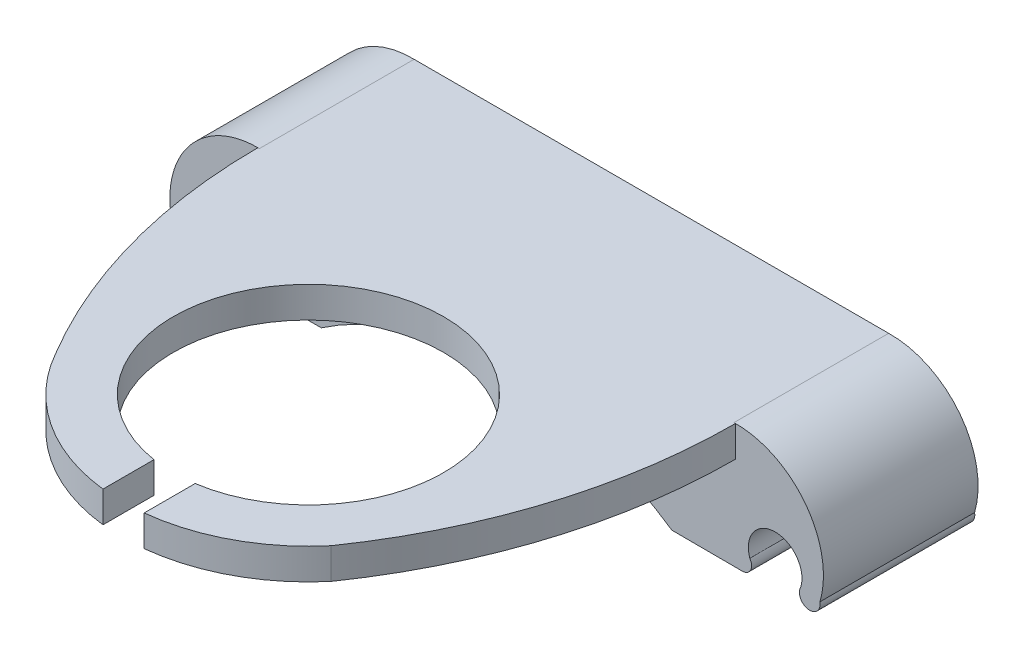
from build123d import *

# Parameters (mm, degrees)
EXTRUDE_1_DEPTH     = 15
SKETCH_2_R          = 13.1
EXTRUDE_2_DEPTH     = 3
CUT_EXTRUDE_1_DEPTH = 70.709658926


with BuildPart() as part:
    # Sketch 1 → Extrude 1 (new body)
    with BuildSketch(Plane.XY):
        with BuildLine():
            Line((-48.75317165, 0), (-55.574899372, -0.025613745))
            ThreePointArc((-55.574899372, -0.025613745), (-56.384360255, 0.467704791), (-56.309824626, 1.412709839))
            ThreePointArc((-56.309824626, 1.412709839), (-58.768154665, 4.862275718), (-61.223704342, 1.410730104))
            ThreePointArc((-61.223704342, 1.410730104), (-61.978317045, -0.033348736), (-63.095743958, 1.152467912))
            ThreePointArc((-63.095743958, 1.152467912), (-61.687985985, 8.70395778), (-54.767107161, 12.036857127))
            Line((-54.767107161, 12.036857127), (-8.767107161, 12.036857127))
            ThreePointArc((-8.767107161, 12.036857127), (-1.846228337, 8.70395778), (-0.438470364, 1.152467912))
            ThreePointArc((-0.438470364, 1.152467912), (-1.555897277, -0.033348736), (-2.310509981, 1.410730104))
            ThreePointArc((-2.310509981, 1.410730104), (-4.766059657, 4.862275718), (-7.224389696, 1.412709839))
            ThreePointArc((-7.224389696, 1.412709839), (-7.149854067, 0.467704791), (-7.959314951, -0.025613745))
            Line((-7.959314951, -0.025613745), (-14.781042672, 0))
            ThreePointArc((-14.781042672, 0), (-31.767107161, 5.229745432), (-48.75317165, 0))
        make_face()
    extrude(amount=EXTRUDE_1_DEPTH)

    # Sketch 2 → Extrude 2 (add)
    with BuildSketch(Plane.XZ.offset(-12.036857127)):
        with BuildLine():
            Line((-54.914436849, 15), (-8.619777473, 15))
            ThreePointArc((-8.619777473, 15), (-11.008523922, 30.638540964), (-17.956911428, 44.850859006))
            ThreePointArc((-17.956911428, 44.850859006), (-33.440442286, 51.190797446), (-47.453322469, 42.048930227))
            ThreePointArc((-47.453322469, 42.048930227), (-53.014966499, 29.029547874), (-54.914436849, 15))
        make_face()
        with Locations((-31.738199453, 33.270979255)):
            Circle(SKETCH_2_R, mode=Mode.SUBTRACT)
    extrude(amount=EXTRUDE_2_DEPTH)

    # Sketch 4 → Cut-Extrude 1 (cut, through all)
    with BuildSketch(Plane.XY.offset(25)):
        with BuildLine():
            Line((-33.767107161, 15.536857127), (-33.767107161, 6.964863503))
            Line((-33.767107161, 6.964863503), (-29.767107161, 6.964863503))
            Line((-29.767107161, 6.964863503), (-29.767107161, 15.536857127))
            ThreePointArc((-29.767107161, 15.536857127), (-31.767107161, 17.536857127), (-33.767107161, 15.536857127))
        make_face()
    extrude(amount=CUT_EXTRUDE_1_DEPTH, mode=Mode.SUBTRACT)


solid = part.part
